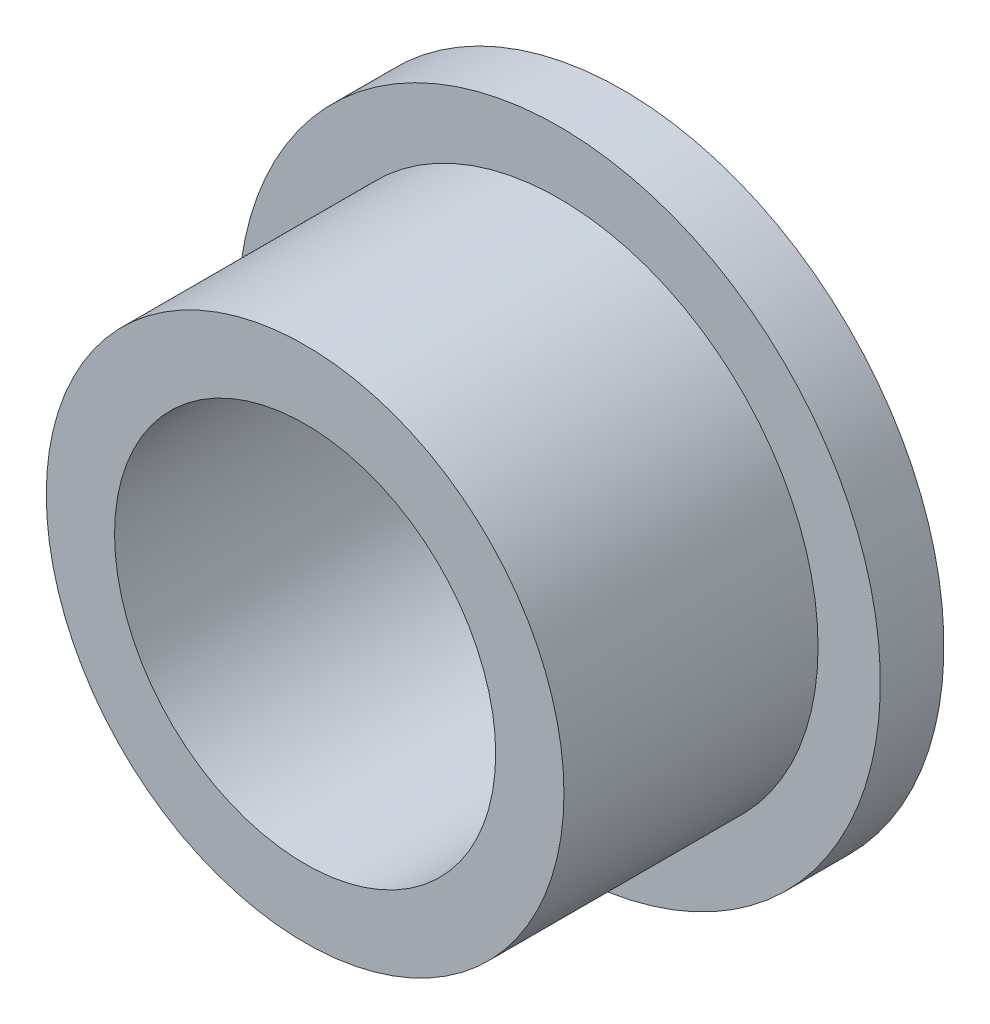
from build123d import *

# Parameters (mm, degrees)
SKETCH_1_R      = 4.075
SKETCH_1_R_2    = 3
EXTRUDE_4_DEPTH = 5
SKETCH_7_R      = 5.056218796
SKETCH_7_R_2    = 4.075
EXTRUDE_5_DEPTH = 1


with BuildPart() as part:
    # Sketch 1 → Extrude 4 (new body)
    with BuildSketch(Plane.XY):
        Circle(SKETCH_1_R)
        Circle(SKETCH_1_R_2, mode=Mode.SUBTRACT)
    extrude(amount=EXTRUDE_4_DEPTH)

    # Sketch 7 → Extrude 5 (add)
    with BuildSketch(Plane(origin=(0, 0, 0), x_dir=(-1, 0, 0), z_dir=(0, 0, -1))):
        Circle(SKETCH_7_R)
        Circle(SKETCH_7_R_2, mode=Mode.SUBTRACT)
    extrude(amount=-EXTRUDE_5_DEPTH)


solid = part.part
